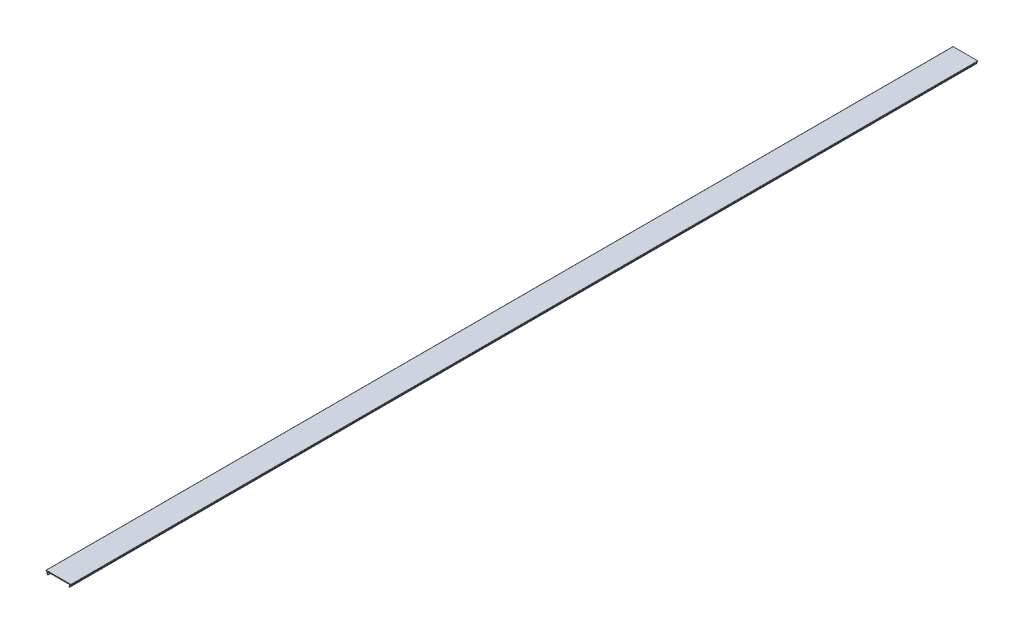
from build123d import *

# Parameters (mm, degrees)
EXTRUDE1_DEPTH      = 813.0032
EXTRUDE1_DEPTH_BACK = 813.0032


with BuildPart() as part:
    # Sketch1 → Extrude1 (new, two sides: drawn at the far end of the back side and taken through both)
    with BuildSketch(Plane.XY.offset(-EXTRUDE1_DEPTH_BACK)):
        with BuildLine():
            Line((20.866044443, -1.374585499), (20.3, -0.7))
            Line((20.3, -0.7), (20.3, 0))
            Line((20.3, 0), (22.3, 0))
            ThreePointArc((22.3, 0), (22.441421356, 0.058578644), (22.5, 0.2))
            Line((22.5, 0.2), (22.5, 0.5))
            ThreePointArc((22.5, 0.5), (22.353553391, 0.853553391), (22, 1))
            Line((22, 1), (-22, 1))
            ThreePointArc((-22, 1), (-22.353553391, 0.853553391), (-22.5, 0.5))
            Line((-22.5, 0.5), (-22.5, 0.2))
            ThreePointArc((-22.5, 0.2), (-22.441421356, 0.058578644), (-22.3, 0))
            Line((-22.3, 0), (-20.3, 0))
            Line((-20.3, 0), (-20.3, -0.7))
            Line((-20.3, -0.7), (-20.866044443, -1.374585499))
            ThreePointArc((-20.866044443, -1.374585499), (-21.096194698, -1.930217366), (-20.966025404, -2.517373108))
            Line((-20.966025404, -2.517373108), (-19.677017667, -4.75))
            ThreePointArc((-19.677017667, -4.75), (-18.994004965, -4.933012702), (-18.810992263, -4.25))
            Line((-18.810992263, -4.25), (-20.1, -2.017373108))
            Line((-20.1, -2.017373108), (-19.533955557, -1.34278761))
            ThreePointArc((-19.533955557, -1.34278761), (-19.360307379, -1.042020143), (-19.3, -0.7))
            Line((-19.3, -0.7), (-19.3, 0))
            Line((-19.3, 0), (-17.5, 0))
            Line((-17.5, 0), (-17, -0.5))
            Line((-17, -0.5), (17, -0.5))
            Line((17, -0.5), (17.5, 0))
            Line((17.5, 0), (19.3, 0))
            Line((19.3, 0), (19.3, -0.7))
            ThreePointArc((19.3, -0.7), (19.360307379, -1.042020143), (19.533955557, -1.34278761))
            Line((19.533955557, -1.34278761), (20.1, -2.017373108))
            Line((20.1, -2.017373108), (18.810992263, -4.25))
            ThreePointArc((18.810992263, -4.25), (18.994004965, -4.933012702), (19.677017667, -4.75))
            Line((19.677017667, -4.75), (20.966025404, -2.517373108))
            ThreePointArc((20.966025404, -2.517373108), (21.096194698, -1.930217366), (20.866044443, -1.374585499))
        make_face()
    extrude(amount=EXTRUDE1_DEPTH + EXTRUDE1_DEPTH_BACK)


solid = part.part
